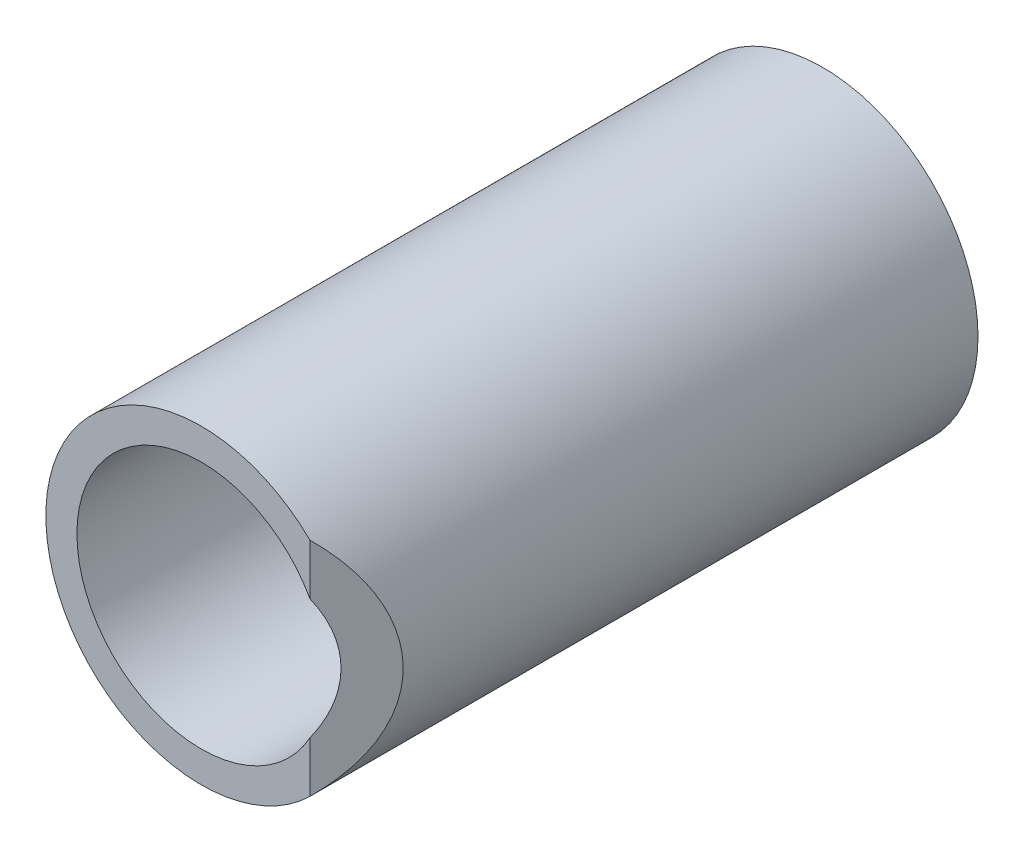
from build123d import *

# Parameters (mm, degrees)
SKETCH1_R           = 25
SKETCH1_R_2         = 20
BOSS_EXTRUDE1_DEPTH = 100
CUT_EXTRUDE1_DEPTH  = 500


with BuildPart() as part:
    # Sketch1 → Boss-Extrude1 (new body)
    with BuildSketch(Plane.XY):
        Circle(SKETCH1_R)
        Circle(SKETCH1_R_2, mode=Mode.SUBTRACT)
    extrude(amount=BOSS_EXTRUDE1_DEPTH)

    # Sketch2 → Cut-Extrude1 (cut)
    with BuildSketch(Plane(origin=(0, -25, 0), x_dir=(-1, 0, 0), z_dir=(0, -1, 0))):
        Polygon((-17.5, -100), (-25, -92.5), (-25, -100), align=None)
    extrude(amount=-CUT_EXTRUDE1_DEPTH, mode=Mode.SUBTRACT)


solid = part.part
